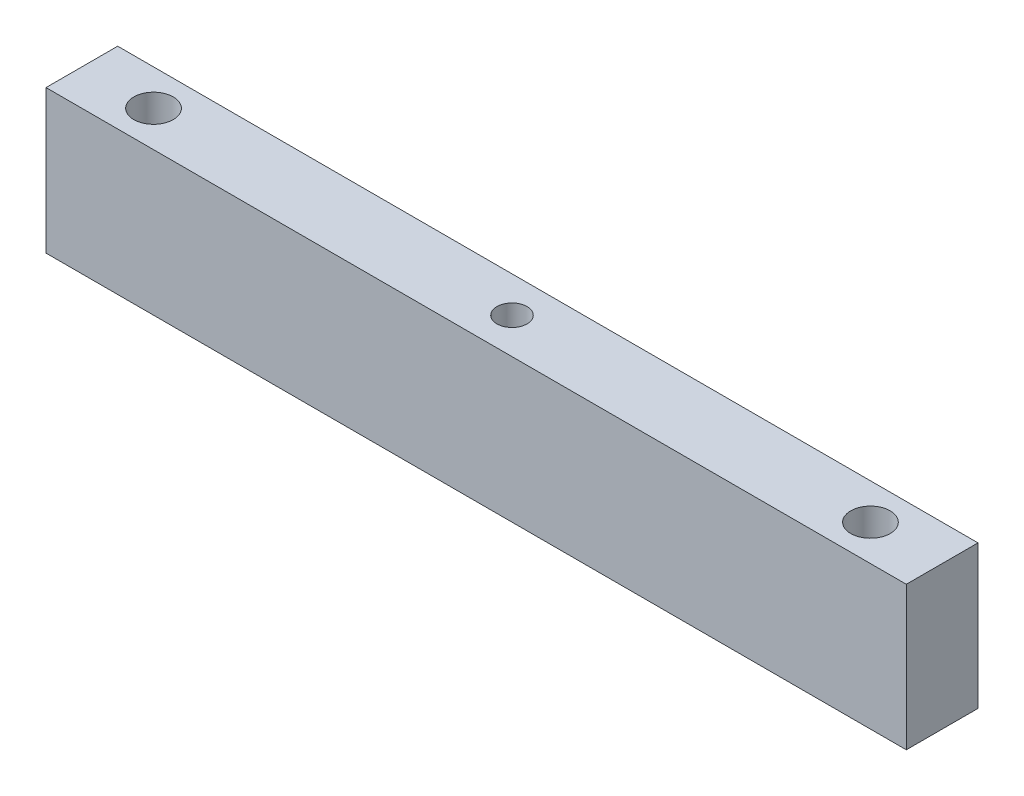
from build123d import *

# Parameters (mm, degrees)
SKETCH_1_W              = 120
SKETCH_1_H              = 20
EXTRUDE_1_DEPTH         = 10
HOLE_WIZARD_M51_D       = 5.5
HOLE_WIZARD_M51_DEPTH   = 20
HOLE_WIZARD_M51_TIP     = 1.652366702
HOLE_WIZARD_M51_2_D     = 4.2
HOLE_WIZARD_M51_2_DEPTH = 20
HOLE_WIZARD_M51_2_TIP   = 1.2618073


with BuildPart() as part:
    # Sketch 1 → Extrude 1 (new body)
    with BuildSketch(Plane.XY):
        Rectangle(SKETCH_1_W, SKETCH_1_H)
    extrude(amount=EXTRUDE_1_DEPTH)

    # Hole Wizard M51
    with Locations(Plane(origin=(0, 10, 0), x_dir=(1, 0, 0), z_dir=(0, 1, 0))):
        with Locations((-50, -5), (50, -5)):
            Hole(HOLE_WIZARD_M51_D / 2, depth=HOLE_WIZARD_M51_DEPTH)
            with Locations((0, 0, -(HOLE_WIZARD_M51_DEPTH + HOLE_WIZARD_M51_TIP / 2))):  # 118° drill point
                Cone(0, HOLE_WIZARD_M51_D / 2, HOLE_WIZARD_M51_TIP, mode=Mode.SUBTRACT)

    # Hole Wizard M51 2
    with Locations(Plane(origin=(0, 10, 0), x_dir=(1, 0, 0), z_dir=(0, 1, 0))):
        with Locations((0, -5)):
            Hole(HOLE_WIZARD_M51_2_D / 2, depth=HOLE_WIZARD_M51_2_DEPTH)
            with Locations((0, 0, -(HOLE_WIZARD_M51_2_DEPTH + HOLE_WIZARD_M51_2_TIP / 2))):  # 118° drill point
                Cone(0, HOLE_WIZARD_M51_2_D / 2, HOLE_WIZARD_M51_2_TIP, mode=Mode.SUBTRACT)


solid = part.part
